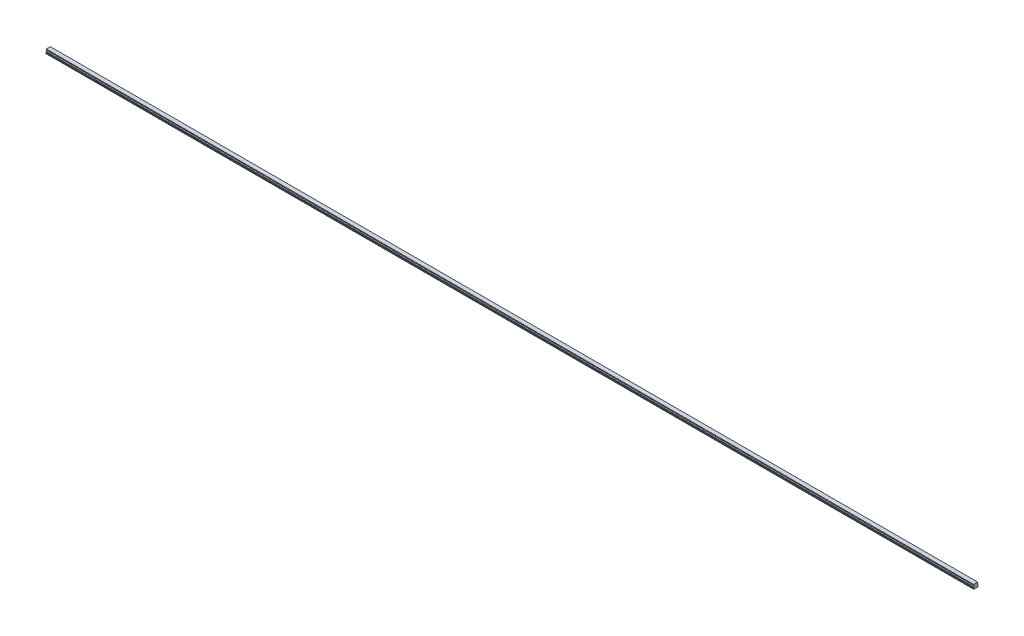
from build123d import *

# Parameters (mm, degrees)
BOSS_EXTRUDE1_DEPTH        = 3000
SKETCH3_R                  = 2.5
SKETCH3_R_2                = 2.1
CUT_EXTRUDE3_DEPTH         = 7
SKETCH3_2_R                = 2.1
CUT_EXTRUDE4_DEPTH         = 9.5
CHAMFER1_SIZE              = 0.4
LPATTERN2_COUNT            = 50
LPATTERN2_PITCH            = 60
CHAMFER1_OF_LPATTERN2_SIZE = 0.4


with BuildPart() as part:
    # Sketch1 → Boss-Extrude1 (new body)
    with BuildSketch(Plane(origin=(0, 0, 0), x_dir=(0, 0, -1), z_dir=(1, 0, 0))):
        with BuildLine():
            Line((6.59, 14), (-6.59, 14))
            Line((-6.59, 14), (-6.59, 13.15))
            Line((-6.59, 13.15), (-6.96, 12.356532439))
            Line((-6.96, 12.356532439), (-6.96, 11.435174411))
            ThreePointArc((-6.96, 11.435174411), (-5.25, 9.5), (-6.96, 7.564825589))
            Line((-6.96, 7.564825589), (-6.96, 6.643467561))
            Line((-6.96, 6.643467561), (-6.59, 5.85))
            Line((-6.59, 5.85), (-7.032116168, 4.2))
            Line((-7.032116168, 4.2), (-7.5, 3.929867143))
            Line((-7.5, 3.929867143), (-7.5, 1.4))
            Line((-7.5, 1.4), (-6.1, 0))
            Line((-6.1, 0), (-3.65, 0))
            Line((-3.65, 0), (-3.25, 0.4))
            Line((-3.25, 0.4), (3.25, 0.4))
            Line((3.25, 0.4), (3.65, 0))
            Line((3.65, 0), (6.1, 0))
            Line((6.1, 0), (7.5, 1.4))
            Line((7.5, 1.4), (7.5, 3.929867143))
            Line((7.5, 3.929867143), (7.032116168, 4.2))
            Line((7.032116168, 4.2), (6.59, 5.85))
            Line((6.59, 5.85), (6.96, 6.643467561))
            Line((6.96, 6.643467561), (6.96, 7.564825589))
            ThreePointArc((6.96, 7.564825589), (5.25, 9.5), (6.96, 11.435174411))
            Line((6.96, 11.435174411), (6.96, 12.356532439))
            Line((6.96, 12.356532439), (6.59, 13.15))
            Line((6.59, 13.15), (6.59, 14))
        make_face()
    extrude(amount=BOSS_EXTRUDE1_DEPTH)

    # Sketch3 → Cut-Extrude3 (cut)
    with BuildSketch(Plane.XZ):
        with Locations(Location((30, 0, 0), (0, 0, 270))):
            Circle(SKETCH3_R)
        with Locations(Location((30, 0, 0), (0, 0, 270))):
            Circle(SKETCH3_R_2, mode=Mode.SUBTRACT)
    cut_extrude3 = extrude(amount=-CUT_EXTRUDE3_DEPTH, mode=Mode.SUBTRACT)

    # Sketch3_2 → Cut-Extrude4 (cut)
    with BuildSketch(Plane.XZ):
        with Locations(Location((30, 0, 0), (0, 0, 270))):
            Circle(SKETCH3_2_R)
    cut_extrude4 = extrude(amount=-CUT_EXTRUDE4_DEPTH, mode=Mode.SUBTRACT)

    # Cut-Extrude5 cone 1 section (on through the dimple's axis) → Cut-Extrude5 (revolve, cut)
    with BuildSketch(Plane(origin=(30, 9.5, 0), x_dir=(0, 0, -1), z_dir=(1, 0, 0))):
        Polygon((0, 0), (2.1, 0), (0, 1.212435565), align=None)
    revolve(axis=Axis((30, 9.5, 0), (0, 1, 0)), mode=Mode.SUBTRACT)

    # Chamfer1
    chamfer1_edges = [part.edges().sort_by_distance(p)[0] for p in [
        (30, 0.4, 2.5),
    ]]
    chamfer(chamfer1_edges, length=CHAMFER1_SIZE)

    # LPattern2: Cut-Extrude3, Cut-Extrude4 ×50
    with Locations(*[(i * LPATTERN2_PITCH, 0, 0) for i in range(1, LPATTERN2_COUNT)]):
        add(cut_extrude3, mode=Mode.SUBTRACT)
        add(cut_extrude4, mode=Mode.SUBTRACT)

    # Chamfer1 of LPattern2
    chamfer1_of_lpattern2_edges = [part.edges().sort_by_distance(p)[0] for p in [
        (90, 0.4, 2.5),
        (150, 0.4, 2.5),
        (210, 0.4, 2.5),
        (270, 0.4, 2.5),
        (330, 0.4, 2.5),
        (390, 0.4, 2.5),
        (450, 0.4, 2.5),
        (510, 0.4, 2.5),
        (570, 0.4, 2.5),
        (630, 0.4, 2.5),
        (690, 0.4, 2.5),
        (750, 0.4, 2.5),
        (810, 0.4, 2.5),
        (870, 0.4, 2.5),
        (930, 0.4, 2.5),
        (990, 0.4, 2.5),
        (1050, 0.4, 2.5),
        (1110, 0.4, 2.5),
        (1170, 0.4, 2.5),
        (1230, 0.4, 2.5),
        (1290, 0.4, 2.5),
        (1350, 0.4, 2.5),
        (1410, 0.4, 2.5),
        (1470, 0.4, 2.5),
        (1530, 0.4, 2.5),
        (1590, 0.4, 2.5),
        (1650, 0.4, 2.5),
        (1710, 0.4, 2.5),
        (1770, 0.4, 2.5),
        (1830, 0.4, 2.5),
        (1890, 0.4, 2.5),
        (1950, 0.4, 2.5),
        (2010, 0.4, 2.5),
        (2070, 0.4, 2.5),
        (2130, 0.4, 2.5),
        (2190, 0.4, 2.5),
        (2250, 0.4, 2.5),
        (2310, 0.4, 2.5),
        (2370, 0.4, 2.5),
        (2430, 0.4, 2.5),
        (2490, 0.4, 2.5),
        (2550, 0.4, 2.5),
        (2610, 0.4, 2.5),
        (2670, 0.4, 2.5),
        (2730, 0.4, 2.5),
        (2790, 0.4, 2.5),
        (2850, 0.4, 2.5),
        (2910, 0.4, 2.5),
        (2970, 0.4, 2.5),
    ]]
    chamfer(chamfer1_of_lpattern2_edges, length=CHAMFER1_OF_LPATTERN2_SIZE)


solid = part.part
